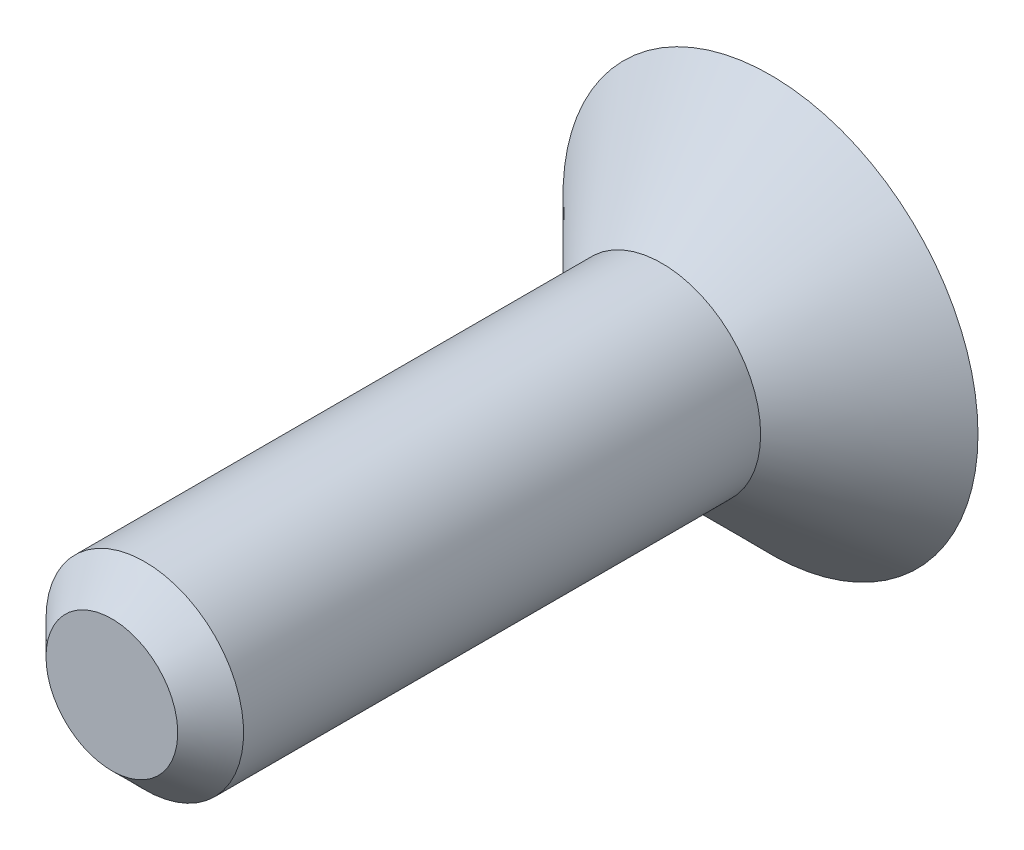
ISO-10303-21;
HEADER;
FILE_DESCRIPTION(('STEP AP214'),'2;1');
FILE_NAME('part.step','',(''),(''),'','','');
FILE_SCHEMA(('AUTOMOTIVE_DESIGN { 1 0 10303 214 1 1 1 1 }'));
ENDSEC;
DATA;
#1=APPLICATION_CONTEXT('core data for automotive mechanical design processes');
#2=APPLICATION_PROTOCOL_DEFINITION('international standard','automotive_design',2000,#1);
#3=PRODUCT_CONTEXT('',#1,'mechanical');
#4=PRODUCT('Part','Part','',(#3));
#5=PRODUCT_RELATED_PRODUCT_CATEGORY('part','',(#4));
#6=PRODUCT_DEFINITION_FORMATION('','',#4);
#7=PRODUCT_DEFINITION_CONTEXT('part definition',#1,'design');
#8=PRODUCT_DEFINITION('design','',#6,#7);
#9=PRODUCT_DEFINITION_SHAPE('','',#8);
#10=(LENGTH_UNIT() NAMED_UNIT(*) SI_UNIT(.MILLI.,.METRE.));
#11=(NAMED_UNIT(*) PLANE_ANGLE_UNIT() SI_UNIT($,.RADIAN.));
#12=(NAMED_UNIT(*) SI_UNIT($,.STERADIAN.) SOLID_ANGLE_UNIT());
#13=UNCERTAINTY_MEASURE_WITH_UNIT(LENGTH_MEASURE(1.E-05),#10,'distance_accuracy_value','');
#14=(GEOMETRIC_REPRESENTATION_CONTEXT(3) GLOBAL_UNCERTAINTY_ASSIGNED_CONTEXT((#13)) GLOBAL_UNIT_ASSIGNED_CONTEXT((#10,
#11,#12)) REPRESENTATION_CONTEXT('',''));
#15=CARTESIAN_POINT('',(0.,0.,0.));
#16=DIRECTION('',(0.,0.,1.));
#17=DIRECTION('',(1.,0.,0.));
#18=AXIS2_PLACEMENT_3D('',#15,#16,#17);
#19=CARTESIAN_POINT('',(0.,0.,0.));
#20=DIRECTION('',(0.,0.,1.));
#21=DIRECTION('',(1.,0.,0.));
#22=AXIS2_PLACEMENT_3D('',#19,#20,#21);
#23=PLANE('',#22);
#24=CARTESIAN_POINT('',(0.,0.,0.));
#25=DIRECTION('',(0.,0.,1.));
#26=DIRECTION('',(1.,0.,0.));
#27=AXIS2_PLACEMENT_3D('',#24,#25,#26);
#28=CIRCLE('',#27,3.15);
#29=CARTESIAN_POINT('',(3.15,0.,0.));
#30=VERTEX_POINT('',#29);
#31=EDGE_CURVE('E97',#30,#30,#28,.T.);
#32=ORIENTED_EDGE('',*,*,#31,.F.);
#33=EDGE_LOOP('',(#32));
#34=FACE_BOUND('',#33,.T.);
#35=DIRECTION('',(0.,-1.,0.));
#36=VECTOR('',#35,1.);
#37=CARTESIAN_POINT('',(-1.04999999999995,1.81865334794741,0.));
#38=LINE('',#37,#36);
#39=CARTESIAN_POINT('',(-1.04999999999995,1.81865334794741,0.));
#40=VERTEX_POINT('',#39);
#41=CARTESIAN_POINT('',(-1.04999999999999,-1.81865334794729,0.));
#42=VERTEX_POINT('',#41);
#43=EDGE_CURVE('E48',#40,#42,#38,.T.);
#44=ORIENTED_EDGE('',*,*,#43,.T.);
#45=DIRECTION('',(0.866025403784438,0.500000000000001,0.));
#46=VECTOR('',#45,1.);
#47=CARTESIAN_POINT('',(-1.04999999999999,-1.81865334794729,0.));
#48=LINE('',#47,#46);
#49=CARTESIAN_POINT('',(2.09999999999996,0.,0.));
#50=VERTEX_POINT('',#49);
#51=EDGE_CURVE('E70',#42,#50,#48,.T.);
#52=ORIENTED_EDGE('',*,*,#51,.T.);
#53=DIRECTION('',(-0.866025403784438,0.500000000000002,0.));
#54=VECTOR('',#53,1.);
#55=CARTESIAN_POINT('',(-1.04999999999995,1.81865334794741,0.));
#56=LINE('',#55,#54);
#57=EDGE_CURVE('E77',#50,#40,#56,.T.);
#58=ORIENTED_EDGE('',*,*,#57,.T.);
#59=EDGE_LOOP('',(#44,#52,#58));
#60=FACE_BOUND('',#59,.T.);
#61=ADVANCED_FACE('F33',(#34,#60),#23,.F.);
#62=CARTESIAN_POINT('',(0.,0.,0.));
#63=DIRECTION('',(0.,0.,-1.));
#64=DIRECTION('',(1.,0.,0.));
#65=AXIS2_PLACEMENT_3D('',#62,#63,#64);
#66=CONICAL_SURFACE('',#65,3.15,0.78539816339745);
#67=CARTESIAN_POINT('',(0.,0.,1.65));
#68=DIRECTION('',(0.,0.,-1.));
#69=DIRECTION('',(-1.,0.,0.));
#70=AXIS2_PLACEMENT_3D('',#67,#68,#69);
#71=CIRCLE('',#70,1.5);
#72=CARTESIAN_POINT('',(-1.49999999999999,0.,1.65));
#73=VERTEX_POINT('',#72);
#74=EDGE_CURVE('E83',#73,#73,#71,.T.);
#75=ORIENTED_EDGE('',*,*,#74,.T.);
#76=EDGE_LOOP('',(#75));
#77=FACE_BOUND('',#76,.T.);
#78=ORIENTED_EDGE('',*,*,#31,.T.);
#79=EDGE_LOOP('',(#78));
#80=FACE_BOUND('',#79,.T.);
#81=ADVANCED_FACE('F35',(#77,#80),#66,.T.);
#82=CARTESIAN_POINT('',(0.,0.,10.));
#83=DIRECTION('',(0.,0.,-1.));
#84=DIRECTION('',(-1.,0.,0.));
#85=AXIS2_PLACEMENT_3D('',#82,#83,#84);
#86=CYLINDRICAL_SURFACE('',#85,1.5);
#87=CARTESIAN_POINT('',(0.,0.,9.50000000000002));
#88=DIRECTION('',(0.,0.,-1.));
#89=DIRECTION('',(-1.,0.,0.));
#90=AXIS2_PLACEMENT_3D('',#87,#88,#89);
#91=CIRCLE('',#90,1.5);
#92=CARTESIAN_POINT('',(-1.49999999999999,0.,9.50000000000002));
#93=VERTEX_POINT('',#92);
#94=EDGE_CURVE('E41',#93,#93,#91,.T.);
#95=ORIENTED_EDGE('',*,*,#94,.T.);
#96=EDGE_LOOP('',(#95));
#97=FACE_BOUND('',#96,.T.);
#98=ORIENTED_EDGE('',*,*,#74,.F.);
#99=EDGE_LOOP('',(#98));
#100=FACE_BOUND('',#99,.T.);
#101=ADVANCED_FACE('F102',(#97,#100),#86,.T.);
#102=CARTESIAN_POINT('',(0.,0.,10.));
#103=DIRECTION('',(0.,0.,-1.));
#104=DIRECTION('',(-1.,0.,0.));
#105=AXIS2_PLACEMENT_3D('',#102,#103,#104);
#106=PLANE('',#105);
#107=CARTESIAN_POINT('',(0.,0.,10.));
#108=DIRECTION('',(0.,0.,-1.));
#109=DIRECTION('',(-1.,0.,0.));
#110=AXIS2_PLACEMENT_3D('',#107,#108,#109);
#111=CIRCLE('',#110,0.999999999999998);
#112=CARTESIAN_POINT('',(-0.999999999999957,0.,10.));
#113=VERTEX_POINT('',#112);
#114=EDGE_CURVE('E11',#113,#113,#111,.F.);
#115=ORIENTED_EDGE('',*,*,#114,.T.);
#116=EDGE_LOOP('',(#115));
#117=FACE_BOUND('',#116,.T.);
#118=ADVANCED_FACE('F127',(#117),#106,.F.);
#119=CARTESIAN_POINT('',(-1.04999999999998,1.81865334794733,0.799999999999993));
#120=DIRECTION('',(1.,0.,0.));
#121=DIRECTION('',(0.,0.,-1.));
#122=AXIS2_PLACEMENT_3D('',#119,#120,#121);
#123=PLANE('',#122);
#124=ORIENTED_EDGE('',*,*,#43,.F.);
#125=DIRECTION('',(0.,0.,-1.));
#126=VECTOR('',#125,1.);
#127=CARTESIAN_POINT('',(-1.04999999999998,1.81865334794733,0.799999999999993));
#128=LINE('',#127,#126);
#129=CARTESIAN_POINT('',(-1.04999999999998,1.81865334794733,0.799999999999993));
#130=VERTEX_POINT('',#129);
#131=EDGE_CURVE('E92',#130,#40,#128,.T.);
#132=ORIENTED_EDGE('',*,*,#131,.F.);
#133=DIRECTION('',(0.,-1.,0.));
#134=VECTOR('',#133,1.);
#135=CARTESIAN_POINT('',(-1.04999999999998,1.81865334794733,0.799999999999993));
#136=LINE('',#135,#134);
#137=CARTESIAN_POINT('',(-1.04999999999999,-1.81865334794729,0.799999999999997));
#138=VERTEX_POINT('',#137);
#139=EDGE_CURVE('E82',#130,#138,#136,.T.);
#140=ORIENTED_EDGE('',*,*,#139,.T.);
#141=DIRECTION('',(0.,0.,-1.));
#142=VECTOR('',#141,1.);
#143=CARTESIAN_POINT('',(-1.04999999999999,-1.81865334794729,0.799999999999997));
#144=LINE('',#143,#142);
#145=EDGE_CURVE('E72',#138,#42,#144,.T.);
#146=ORIENTED_EDGE('',*,*,#145,.T.);
#147=EDGE_LOOP('',(#124,#132,#140,#146));
#148=FACE_BOUND('',#147,.T.);
#149=ADVANCED_FACE('F80',(#148),#123,.T.);
#150=CARTESIAN_POINT('',(-1.04999999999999,-1.81865334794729,0.799999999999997));
#151=DIRECTION('',(-0.5,0.866025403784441,0.));
#152=DIRECTION('',(-0.866025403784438,-0.500000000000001,0.));
#153=AXIS2_PLACEMENT_3D('',#150,#151,#152);
#154=PLANE('',#153);
#155=ORIENTED_EDGE('',*,*,#51,.F.);
#156=ORIENTED_EDGE('',*,*,#145,.F.);
#157=DIRECTION('',(0.866025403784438,0.500000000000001,0.));
#158=VECTOR('',#157,1.);
#159=CARTESIAN_POINT('',(-1.04999999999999,-1.81865334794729,0.799999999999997));
#160=LINE('',#159,#158);
#161=CARTESIAN_POINT('',(2.10000000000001,0.,0.799999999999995));
#162=VERTEX_POINT('',#161);
#163=EDGE_CURVE('E89',#138,#162,#160,.T.);
#164=ORIENTED_EDGE('',*,*,#163,.T.);
#165=DIRECTION('',(0.,0.,-1.));
#166=VECTOR('',#165,1.);
#167=CARTESIAN_POINT('',(2.10000000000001,0.,0.799999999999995));
#168=LINE('',#167,#166);
#169=EDGE_CURVE('E73',#162,#50,#168,.T.);
#170=ORIENTED_EDGE('',*,*,#169,.T.);
#171=EDGE_LOOP('',(#155,#156,#164,#170));
#172=FACE_BOUND('',#171,.T.);
#173=ADVANCED_FACE('F71',(#172),#154,.T.);
#174=CARTESIAN_POINT('',(-1.04999999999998,1.81865334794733,0.799999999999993));
#175=DIRECTION('',(-0.5,-0.866025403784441,0.));
#176=DIRECTION('',(0.866025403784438,-0.500000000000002,0.));
#177=AXIS2_PLACEMENT_3D('',#174,#175,#176);
#178=PLANE('',#177);
#179=ORIENTED_EDGE('',*,*,#57,.F.);
#180=ORIENTED_EDGE('',*,*,#169,.F.);
#181=DIRECTION('',(-0.866025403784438,0.500000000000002,0.));
#182=VECTOR('',#181,1.);
#183=CARTESIAN_POINT('',(-1.04999999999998,1.81865334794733,0.799999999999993));
#184=LINE('',#183,#182);
#185=EDGE_CURVE('E55',#162,#130,#184,.T.);
#186=ORIENTED_EDGE('',*,*,#185,.T.);
#187=ORIENTED_EDGE('',*,*,#131,.T.);
#188=EDGE_LOOP('',(#179,#180,#186,#187));
#189=FACE_BOUND('',#188,.T.);
#190=ADVANCED_FACE('F113',(#189),#178,.T.);
#191=CARTESIAN_POINT('',(-1.04999999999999,-1.81865334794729,0.799999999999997));
#192=DIRECTION('',(0.,0.,1.));
#193=DIRECTION('',(1.,0.,0.));
#194=AXIS2_PLACEMENT_3D('',#191,#192,#193);
#195=PLANE('',#194);
#196=ORIENTED_EDGE('',*,*,#139,.F.);
#197=ORIENTED_EDGE('',*,*,#185,.F.);
#198=ORIENTED_EDGE('',*,*,#163,.F.);
#199=EDGE_LOOP('',(#196,#197,#198));
#200=FACE_BOUND('',#199,.T.);
#201=ADVANCED_FACE('F107',(#200),#195,.F.);
#202=CARTESIAN_POINT('',(0.,0.,9.50000000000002));
#203=DIRECTION('',(0.,0.,-1.));
#204=DIRECTION('',(-1.,0.,0.));
#205=AXIS2_PLACEMENT_3D('',#202,#203,#204);
#206=CONICAL_SURFACE('',#205,1.5,0.785398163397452);
#207=ORIENTED_EDGE('',*,*,#114,.F.);
#208=EDGE_LOOP('',(#207));
#209=FACE_BOUND('',#208,.T.);
#210=ORIENTED_EDGE('',*,*,#94,.F.);
#211=EDGE_LOOP('',(#210));
#212=FACE_BOUND('',#211,.T.);
#213=ADVANCED_FACE('F105',(#209,#212),#206,.T.);
#214=CLOSED_SHELL('',(#61,#81,#101,#118,#149,#173,#190,#201,#213));
#215=MANIFOLD_SOLID_BREP('B2',#214);
#216=ADVANCED_BREP_SHAPE_REPRESENTATION('',(#18,#215),#14);
#217=SHAPE_DEFINITION_REPRESENTATION(#9,#216);
ENDSEC;
END-ISO-10303-21;
